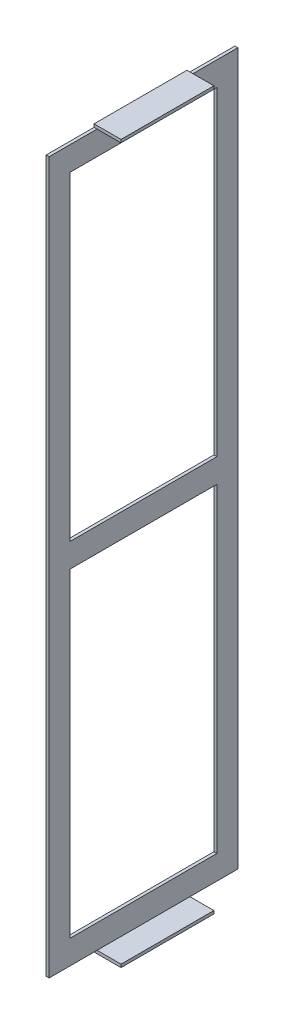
from build123d import *

# Parameters (mm, degrees)
SKETCH1_W                      = 103.175
SKETCH1_H                      = 103.175
SKETCH1_W_2                    = 100
SKETCH1_H_2                    = 100
BULKSHELLEXTRUDE_DEPTH         = 376.8
SKETCH14_W                     = 77.775
SKETCH14_H                     = 351.4
SIDEWALLCUT_DEPTH              = 103.1875
SIDEWALLCUTPATTERN_COUNT       = 4
SKETCH20_W                     = 77.775
SKETCH20_H                     = 12.7
CENTERSUPPORT_DEPTH            = 1.5875
CENTERSUPPORTPATTERNCIRC_COUNT = 4
SKETCH21_W                     = 1.5875
SKETCH21_H                     = 376.8
CUT_EXTRUDE2_DEPTH             = 103.1875
SKETCH22_W                     = 1.5875
SKETCH22_H                     = 49.2
BOSS_EXTRUDE1_DEPTH            = 1.5875
SKETCH23_W                     = 49.2
SKETCH23_H                     = 1.5875
BOSS_EXTRUDE2_DEPTH            = 12.7


with BuildPart() as part:
    # Sketch1 → BulkShellExtrude (new body)
    with BuildSketch(Plane(origin=(0, 0, 0), x_dir=(1, 0, 0), z_dir=(0, 1, 0))):
        Rectangle(SKETCH1_W, SKETCH1_H)
        Rectangle(SKETCH1_W_2, SKETCH1_H_2, mode=Mode.SUBTRACT)
    extrude(amount=BULKSHELLEXTRUDE_DEPTH)

    # Sketch14 → SideWallCut (cut)
    with BuildSketch(Plane(origin=(51.5875, 0, 0), x_dir=(0, 0, -1), z_dir=(1, 0, 0))):
        with Locations((0, 188.4)):
            Rectangle(SKETCH14_W, SKETCH14_H)
    sidewallcut = extrude(amount=-SIDEWALLCUT_DEPTH, mode=Mode.SUBTRACT)

    # SideWallCutPattern: SideWallCut ×4 about axis
    sidewallcutpattern_axis = Axis((0, 0, 0), (0, 1, 0))
    for i in range(1, SIDEWALLCUTPATTERN_COUNT):
        add(sidewallcut.rotate(sidewallcutpattern_axis, i * 360 / SIDEWALLCUTPATTERN_COUNT), mode=Mode.SUBTRACT)

    # Sketch20 → CenterSupport (add)
    with BuildSketch(Plane.XY.offset(51.5875)):
        with Locations((0, 188.4)):
            Rectangle(SKETCH20_W, SKETCH20_H)
    centersupport = extrude(amount=-CENTERSUPPORT_DEPTH)

    # CenterSupportPatternCirc: CenterSupport ×4 about axis
    centersupportpatterncirc_axis = Axis((0, 0, 0), (0, 1, 0))
    for i in range(1, CENTERSUPPORTPATTERNCIRC_COUNT):
        add(centersupport.rotate(centersupportpatterncirc_axis, i * 360 / CENTERSUPPORTPATTERNCIRC_COUNT))

    # Sketch21 → Cut-Extrude2 (cut)
    with BuildSketch(Plane(origin=(51.5875, 0, 0), x_dir=(0, 0, -1), z_dir=(1, 0, 0))):
        with Locations((-50.79375, 188.4)):
            Rectangle(SKETCH21_W, SKETCH21_H)
        with Locations((50.79375, 188.4)):
            Rectangle(SKETCH21_W, SKETCH21_H)
    extrude(amount=-CUT_EXTRUDE2_DEPTH, mode=Mode.SUBTRACT)


with BuildPart() as body_2:
    # of the pieces the cut leaves, the one that is kept (cut_extrude2_keep)
    add(part.part.solids().sort_by_distance((51.5875, 0, 50))[0])

    # Sketch22 → Boss-Extrude1 (add)
    with BuildSketch(Plane(origin=(0, 376.8, 0), x_dir=(1, 0, 0), z_dir=(0, 1, 0))):
        with Locations((50.79375, 0)):
            Rectangle(SKETCH22_W, SKETCH22_H)
    boss_extrude1 = extrude(amount=BOSS_EXTRUDE1_DEPTH)

    # Sketch23 → Boss-Extrude2 (add)
    with BuildSketch(Plane(origin=(51.5875, 0, 0), x_dir=(0, 0, -1), z_dir=(1, 0, 0))):
        with Locations((0, 377.59375)):
            Rectangle(SKETCH23_W, SKETCH23_H)
    boss_extrude2 = extrude(amount=BOSS_EXTRUDE2_DEPTH)

    # Mirror1: Boss-Extrude1, Boss-Extrude2 across plane
    add(boss_extrude1.mirror(Plane.ZX.offset(188.4)))
    add(boss_extrude2.mirror(Plane.ZX.offset(188.4)))


solid = body_2.part
